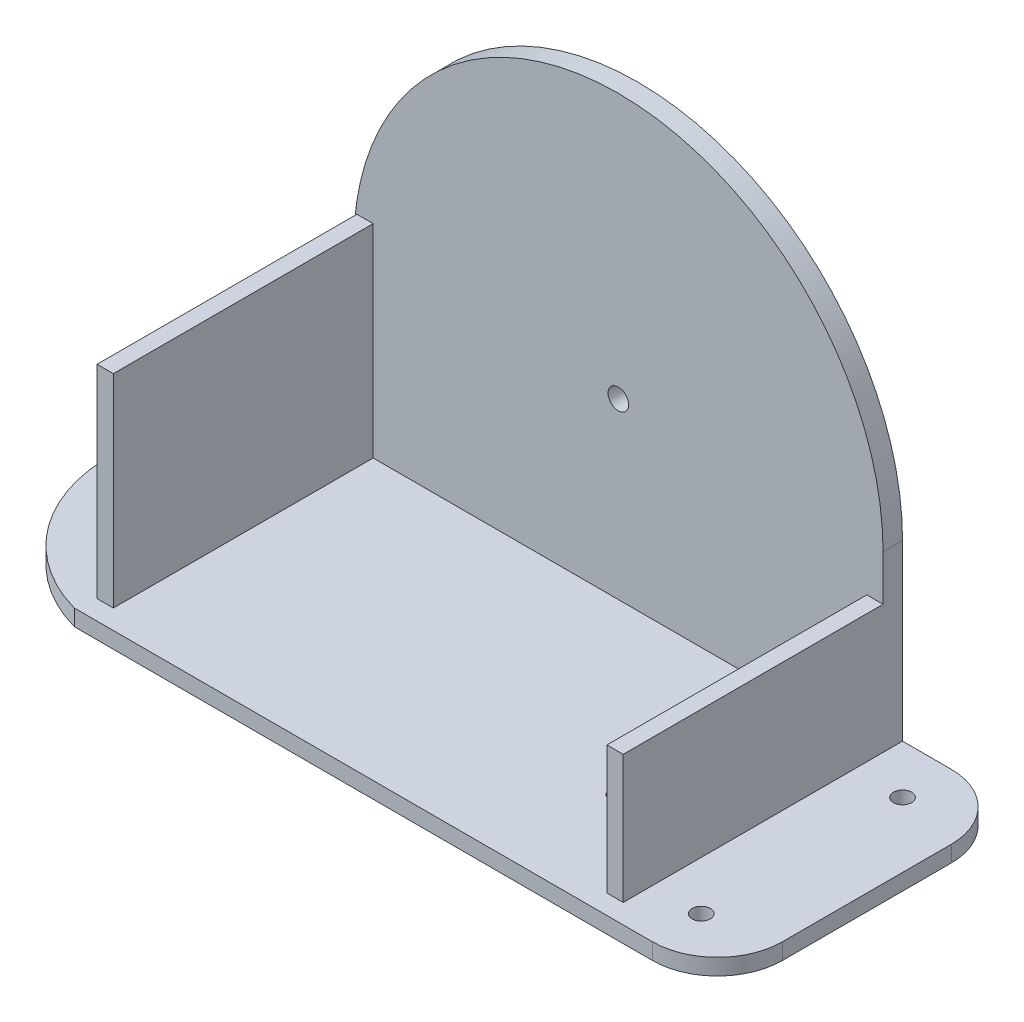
ISO-10303-21;
HEADER;
FILE_DESCRIPTION(('STEP AP214'),'2;1');
FILE_NAME('part.step','',(''),(''),'','','');
FILE_SCHEMA(('AUTOMOTIVE_DESIGN { 1 0 10303 214 1 1 1 1 }'));
ENDSEC;
DATA;
#1=APPLICATION_CONTEXT('core data for automotive mechanical design processes');
#2=APPLICATION_PROTOCOL_DEFINITION('international standard','automotive_design',2000,#1);
#3=PRODUCT_CONTEXT('',#1,'mechanical');
#4=PRODUCT('Part','Part','',(#3));
#5=PRODUCT_RELATED_PRODUCT_CATEGORY('part','',(#4));
#6=PRODUCT_DEFINITION_FORMATION('','',#4);
#7=PRODUCT_DEFINITION_CONTEXT('part definition',#1,'design');
#8=PRODUCT_DEFINITION('design','',#6,#7);
#9=PRODUCT_DEFINITION_SHAPE('','',#8);
#10=(LENGTH_UNIT() NAMED_UNIT(*) SI_UNIT(.MILLI.,.METRE.));
#11=(NAMED_UNIT(*) PLANE_ANGLE_UNIT() SI_UNIT($,.RADIAN.));
#12=(NAMED_UNIT(*) SI_UNIT($,.STERADIAN.) SOLID_ANGLE_UNIT());
#13=UNCERTAINTY_MEASURE_WITH_UNIT(LENGTH_MEASURE(1.E-05),#10,'distance_accuracy_value','');
#14=(GEOMETRIC_REPRESENTATION_CONTEXT(3) GLOBAL_UNCERTAINTY_ASSIGNED_CONTEXT((#13)) GLOBAL_UNIT_ASSIGNED_CONTEXT((#10,
#11,#12)) REPRESENTATION_CONTEXT('',''));
#15=CARTESIAN_POINT('',(0.,0.,0.));
#16=DIRECTION('',(0.,0.,1.));
#17=DIRECTION('',(1.,0.,0.));
#18=AXIS2_PLACEMENT_3D('',#15,#16,#17);
#19=CARTESIAN_POINT('',(51.5,-58.5,33.5));
#20=DIRECTION('',(0.,1.,0.));
#21=DIRECTION('',(0.,0.,1.));
#22=AXIS2_PLACEMENT_3D('',#19,#20,#21);
#23=CYLINDRICAL_SURFACE('',#22,2.);
#24=CARTESIAN_POINT('',(51.5,-53.5,33.5));
#25=DIRECTION('',(0.,1.,0.));
#26=DIRECTION('',(0.,0.,1.));
#27=AXIS2_PLACEMENT_3D('',#24,#25,#26);
#28=CIRCLE('',#27,2.);
#29=CARTESIAN_POINT('',(51.5,-53.5,35.5));
#30=VERTEX_POINT('',#29);
#31=EDGE_CURVE('E148',#30,#30,#28,.T.);
#32=ORIENTED_EDGE('',*,*,#31,.T.);
#33=EDGE_LOOP('',(#32));
#34=FACE_BOUND('',#33,.T.);
#35=CARTESIAN_POINT('',(51.5,-55.5,33.5));
#36=DIRECTION('',(0.,-1.,0.));
#37=DIRECTION('',(0.,0.,-1.));
#38=AXIS2_PLACEMENT_3D('',#35,#36,#37);
#39=CIRCLE('',#38,2.);
#40=CARTESIAN_POINT('',(51.5,-55.5,31.5));
#41=VERTEX_POINT('',#40);
#42=EDGE_CURVE('E51',#41,#41,#39,.F.);
#43=ORIENTED_EDGE('',*,*,#42,.F.);
#44=EDGE_LOOP('',(#43));
#45=FACE_BOUND('',#44,.T.);
#46=ADVANCED_FACE('F47',(#34,#45),#23,.F.);
#47=CARTESIAN_POINT('',(51.5,-58.5,58.5));
#48=DIRECTION('',(0.,1.,0.));
#49=DIRECTION('',(0.,0.,1.));
#50=AXIS2_PLACEMENT_3D('',#47,#48,#49);
#51=CYLINDRICAL_SURFACE('',#50,2.);
#52=CARTESIAN_POINT('',(51.5,-53.5,58.5));
#53=DIRECTION('',(0.,1.,0.));
#54=DIRECTION('',(0.,0.,1.));
#55=AXIS2_PLACEMENT_3D('',#52,#53,#54);
#56=CIRCLE('',#55,2.);
#57=CARTESIAN_POINT('',(51.5,-53.5,60.5));
#58=VERTEX_POINT('',#57);
#59=EDGE_CURVE('E171',#58,#58,#56,.T.);
#60=ORIENTED_EDGE('',*,*,#59,.T.);
#61=EDGE_LOOP('',(#60));
#62=FACE_BOUND('',#61,.T.);
#63=CARTESIAN_POINT('',(51.5,-55.5,58.5));
#64=DIRECTION('',(0.,-1.,0.));
#65=DIRECTION('',(0.,0.,-1.));
#66=AXIS2_PLACEMENT_3D('',#63,#64,#65);
#67=CIRCLE('',#66,2.);
#68=CARTESIAN_POINT('',(51.5,-55.5,56.5));
#69=VERTEX_POINT('',#68);
#70=EDGE_CURVE('E169',#69,#69,#67,.F.);
#71=ORIENTED_EDGE('',*,*,#70,.F.);
#72=EDGE_LOOP('',(#71));
#73=FACE_BOUND('',#72,.T.);
#74=ADVANCED_FACE('F218',(#62,#73),#51,.F.);
#75=CARTESIAN_POINT('',(-68.7714285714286,-58.5,46.));
#76=DIRECTION('',(0.,1.,0.));
#77=DIRECTION('',(0.,0.,1.));
#78=AXIS2_PLACEMENT_3D('',#75,#76,#77);
#79=CYLINDRICAL_SURFACE('',#78,47.7285714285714);
#80=CARTESIAN_POINT('',(-68.7714285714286,-53.5,46.));
#81=DIRECTION('',(0.,-1.,0.));
#82=DIRECTION('',(0.,0.,-1.));
#83=AXIS2_PLACEMENT_3D('',#80,#81,#82);
#84=CIRCLE('',#83,47.7285714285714);
#85=CARTESIAN_POINT('',(-81.5,-53.5,92.));
#86=VERTEX_POINT('',#85);
#87=CARTESIAN_POINT('',(-81.5,-53.5,0.));
#88=VERTEX_POINT('',#87);
#89=EDGE_CURVE('E144',#86,#88,#84,.T.);
#90=ORIENTED_EDGE('',*,*,#89,.T.);
#91=DIRECTION('',(0.,1.,0.));
#92=VECTOR('',#91,1.);
#93=CARTESIAN_POINT('',(-81.5,-58.5,0.));
#94=LINE('',#93,#92);
#95=CARTESIAN_POINT('',(-81.5,-58.5,0.));
#96=VERTEX_POINT('',#95);
#97=EDGE_CURVE('E12',#96,#88,#94,.T.);
#98=ORIENTED_EDGE('',*,*,#97,.F.);
#99=CARTESIAN_POINT('',(-68.7714285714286,-58.5,46.));
#100=DIRECTION('',(0.,-1.,0.));
#101=DIRECTION('',(0.,0.,-1.));
#102=AXIS2_PLACEMENT_3D('',#99,#100,#101);
#103=CIRCLE('',#102,47.7285714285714);
#104=CARTESIAN_POINT('',(-81.5,-58.5,92.));
#105=VERTEX_POINT('',#104);
#106=EDGE_CURVE('E164',#105,#96,#103,.T.);
#107=ORIENTED_EDGE('',*,*,#106,.F.);
#108=DIRECTION('',(0.,1.,0.));
#109=VECTOR('',#108,1.);
#110=CARTESIAN_POINT('',(-81.5,-58.5,92.));
#111=LINE('',#110,#109);
#112=EDGE_CURVE('E143',#105,#86,#111,.T.);
#113=ORIENTED_EDGE('',*,*,#112,.T.);
#114=EDGE_LOOP('',(#90,#98,#107,#113));
#115=FACE_BOUND('',#114,.T.);
#116=ADVANCED_FACE('F49',(#115),#79,.T.);
#117=CARTESIAN_POINT('',(0.,-58.5,0.));
#118=DIRECTION('',(0.,0.,1.));
#119=DIRECTION('',(1.,0.,0.));
#120=AXIS2_PLACEMENT_3D('',#117,#118,#119);
#121=PLANE('',#120);
#122=DIRECTION('',(1.,0.,0.));
#123=VECTOR('',#122,1.);
#124=CARTESIAN_POINT('',(0.,-53.5,0.));
#125=LINE('',#124,#123);
#126=CARTESIAN_POINT('',(96.4999999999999,-53.5,0.));
#127=VERTEX_POINT('',#126);
#128=EDGE_CURVE('E147',#88,#127,#125,.T.);
#129=ORIENTED_EDGE('',*,*,#128,.T.);
#130=DIRECTION('',(0.,1.,0.));
#131=VECTOR('',#130,1.);
#132=CARTESIAN_POINT('',(96.4999999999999,-58.5,0.));
#133=LINE('',#132,#131);
#134=CARTESIAN_POINT('',(96.4999999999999,-58.5,0.));
#135=VERTEX_POINT('',#134);
#136=EDGE_CURVE('E57',#135,#127,#133,.T.);
#137=ORIENTED_EDGE('',*,*,#136,.F.);
#138=DIRECTION('',(1.,0.,0.));
#139=VECTOR('',#138,1.);
#140=CARTESIAN_POINT('',(0.,-58.5,0.));
#141=LINE('',#140,#139);
#142=EDGE_CURVE('E103',#96,#135,#141,.T.);
#143=ORIENTED_EDGE('',*,*,#142,.F.);
#144=ORIENTED_EDGE('',*,*,#97,.T.);
#145=EDGE_LOOP('',(#129,#137,#143,#144));
#146=FACE_BOUND('',#145,.T.);
#147=ADVANCED_FACE('F193',(#146),#121,.F.);
#148=CARTESIAN_POINT('',(96.5,-58.5,20.));
#149=DIRECTION('',(0.,1.,0.));
#150=DIRECTION('',(0.,0.,1.));
#151=AXIS2_PLACEMENT_3D('',#148,#149,#150);
#152=CYLINDRICAL_SURFACE('',#151,20.);
#153=CARTESIAN_POINT('',(96.5,-53.5,20.));
#154=DIRECTION('',(0.,-1.,0.));
#155=DIRECTION('',(0.,0.,-1.));
#156=AXIS2_PLACEMENT_3D('',#153,#154,#155);
#157=CIRCLE('',#156,20.);
#158=CARTESIAN_POINT('',(116.5,-53.5,20.0000000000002));
#159=VERTEX_POINT('',#158);
#160=EDGE_CURVE('E150',#127,#159,#157,.T.);
#161=ORIENTED_EDGE('',*,*,#160,.T.);
#162=DIRECTION('',(0.,1.,0.));
#163=VECTOR('',#162,1.);
#164=CARTESIAN_POINT('',(116.5,-58.5,20.0000000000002));
#165=LINE('',#164,#163);
#166=CARTESIAN_POINT('',(116.5,-58.5,20.0000000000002));
#167=VERTEX_POINT('',#166);
#168=EDGE_CURVE('E126',#167,#159,#165,.T.);
#169=ORIENTED_EDGE('',*,*,#168,.F.);
#170=CARTESIAN_POINT('',(96.5,-58.5,20.));
#171=DIRECTION('',(0.,-1.,0.));
#172=DIRECTION('',(0.,0.,-1.));
#173=AXIS2_PLACEMENT_3D('',#170,#171,#172);
#174=CIRCLE('',#173,20.);
#175=EDGE_CURVE('E117',#135,#167,#174,.T.);
#176=ORIENTED_EDGE('',*,*,#175,.F.);
#177=ORIENTED_EDGE('',*,*,#136,.T.);
#178=EDGE_LOOP('',(#161,#169,#176,#177));
#179=FACE_BOUND('',#178,.T.);
#180=ADVANCED_FACE('F196',(#179),#152,.T.);
#181=CARTESIAN_POINT('',(116.5,-58.5,0.));
#182=DIRECTION('',(-1.,0.,0.));
#183=DIRECTION('',(0.,0.,1.));
#184=AXIS2_PLACEMENT_3D('',#181,#182,#183);
#185=PLANE('',#184);
#186=DIRECTION('',(0.,0.,1.));
#187=VECTOR('',#186,1.);
#188=CARTESIAN_POINT('',(116.5,-53.5,0.));
#189=LINE('',#188,#187);
#190=CARTESIAN_POINT('',(116.5,-53.5,71.9999999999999));
#191=VERTEX_POINT('',#190);
#192=EDGE_CURVE('E125',#159,#191,#189,.T.);
#193=ORIENTED_EDGE('',*,*,#192,.T.);
#194=DIRECTION('',(0.,1.,0.));
#195=VECTOR('',#194,1.);
#196=CARTESIAN_POINT('',(116.5,-58.5,71.9999999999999));
#197=LINE('',#196,#195);
#198=CARTESIAN_POINT('',(116.5,-58.5,71.9999999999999));
#199=VERTEX_POINT('',#198);
#200=EDGE_CURVE('E122',#199,#191,#197,.T.);
#201=ORIENTED_EDGE('',*,*,#200,.F.);
#202=DIRECTION('',(0.,0.,1.));
#203=VECTOR('',#202,1.);
#204=CARTESIAN_POINT('',(116.5,-58.5,0.));
#205=LINE('',#204,#203);
#206=EDGE_CURVE('E110',#167,#199,#205,.T.);
#207=ORIENTED_EDGE('',*,*,#206,.F.);
#208=ORIENTED_EDGE('',*,*,#168,.T.);
#209=EDGE_LOOP('',(#193,#201,#207,#208));
#210=FACE_BOUND('',#209,.T.);
#211=ADVANCED_FACE('F123',(#210),#185,.F.);
#212=CARTESIAN_POINT('',(96.5,-58.5,72.));
#213=DIRECTION('',(0.,1.,0.));
#214=DIRECTION('',(0.,0.,1.));
#215=AXIS2_PLACEMENT_3D('',#212,#213,#214);
#216=CYLINDRICAL_SURFACE('',#215,20.);
#217=CARTESIAN_POINT('',(96.5,-53.5,72.));
#218=DIRECTION('',(0.,-1.,0.));
#219=DIRECTION('',(0.,0.,-1.));
#220=AXIS2_PLACEMENT_3D('',#217,#218,#219);
#221=CIRCLE('',#220,20.);
#222=CARTESIAN_POINT('',(96.4999999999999,-53.5,92.));
#223=VERTEX_POINT('',#222);
#224=EDGE_CURVE('E89',#191,#223,#221,.T.);
#225=ORIENTED_EDGE('',*,*,#224,.T.);
#226=DIRECTION('',(0.,1.,0.));
#227=VECTOR('',#226,1.);
#228=CARTESIAN_POINT('',(96.4999999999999,-58.5,92.));
#229=LINE('',#228,#227);
#230=CARTESIAN_POINT('',(96.4999999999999,-58.5,92.));
#231=VERTEX_POINT('',#230);
#232=EDGE_CURVE('E127',#231,#223,#229,.T.);
#233=ORIENTED_EDGE('',*,*,#232,.F.);
#234=CARTESIAN_POINT('',(96.5,-58.5,72.));
#235=DIRECTION('',(0.,-1.,0.));
#236=DIRECTION('',(0.,0.,-1.));
#237=AXIS2_PLACEMENT_3D('',#234,#235,#236);
#238=CIRCLE('',#237,20.);
#239=EDGE_CURVE('E115',#199,#231,#238,.T.);
#240=ORIENTED_EDGE('',*,*,#239,.F.);
#241=ORIENTED_EDGE('',*,*,#200,.T.);
#242=EDGE_LOOP('',(#225,#233,#240,#241));
#243=FACE_BOUND('',#242,.T.);
#244=ADVANCED_FACE('F129',(#243),#216,.T.);
#245=CARTESIAN_POINT('',(96.5,-58.5,15.));
#246=DIRECTION('',(0.,1.,0.));
#247=DIRECTION('',(0.,0.,1.));
#248=AXIS2_PLACEMENT_3D('',#245,#246,#247);
#249=CYLINDRICAL_SURFACE('',#248,2.79999999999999);
#250=CARTESIAN_POINT('',(96.5,-58.5,15.));
#251=DIRECTION('',(0.,-1.,0.));
#252=DIRECTION('',(0.,0.,-1.));
#253=AXIS2_PLACEMENT_3D('',#250,#251,#252);
#254=CIRCLE('',#253,2.79999999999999);
#255=CARTESIAN_POINT('',(96.5,-58.5,12.2));
#256=VERTEX_POINT('',#255);
#257=EDGE_CURVE('E137',#256,#256,#254,.T.);
#258=ORIENTED_EDGE('',*,*,#257,.T.);
#259=EDGE_LOOP('',(#258));
#260=FACE_BOUND('',#259,.T.);
#261=CARTESIAN_POINT('',(96.5,-53.5,15.));
#262=DIRECTION('',(0.,-1.,0.));
#263=DIRECTION('',(0.,0.,-1.));
#264=AXIS2_PLACEMENT_3D('',#261,#262,#263);
#265=CIRCLE('',#264,2.79999999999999);
#266=CARTESIAN_POINT('',(96.5,-53.5,12.2));
#267=VERTEX_POINT('',#266);
#268=EDGE_CURVE('E158',#267,#267,#265,.T.);
#269=ORIENTED_EDGE('',*,*,#268,.F.);
#270=EDGE_LOOP('',(#269));
#271=FACE_BOUND('',#270,.T.);
#272=ADVANCED_FACE('F213',(#260,#271),#249,.F.);
#273=CARTESIAN_POINT('',(-95.5,-58.5,46.));
#274=DIRECTION('',(0.,1.,0.));
#275=DIRECTION('',(0.,0.,1.));
#276=AXIS2_PLACEMENT_3D('',#273,#274,#275);
#277=CYLINDRICAL_SURFACE('',#276,2.79999999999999);
#278=CARTESIAN_POINT('',(-95.5,-58.5,46.));
#279=DIRECTION('',(0.,-1.,0.));
#280=DIRECTION('',(0.,0.,-1.));
#281=AXIS2_PLACEMENT_3D('',#278,#279,#280);
#282=CIRCLE('',#281,2.79999999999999);
#283=CARTESIAN_POINT('',(-95.5,-58.5,43.2));
#284=VERTEX_POINT('',#283);
#285=EDGE_CURVE('E131',#284,#284,#282,.T.);
#286=ORIENTED_EDGE('',*,*,#285,.T.);
#287=EDGE_LOOP('',(#286));
#288=FACE_BOUND('',#287,.T.);
#289=CARTESIAN_POINT('',(-95.5,-53.5,46.));
#290=DIRECTION('',(0.,-1.,0.));
#291=DIRECTION('',(0.,0.,-1.));
#292=AXIS2_PLACEMENT_3D('',#289,#290,#291);
#293=CIRCLE('',#292,2.79999999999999);
#294=CARTESIAN_POINT('',(-95.5,-53.5,43.2));
#295=VERTEX_POINT('',#294);
#296=EDGE_CURVE('E155',#295,#295,#293,.T.);
#297=ORIENTED_EDGE('',*,*,#296,.F.);
#298=EDGE_LOOP('',(#297));
#299=FACE_BOUND('',#298,.T.);
#300=ADVANCED_FACE('F205',(#288,#299),#277,.F.);
#301=CARTESIAN_POINT('',(0.,-58.5,92.));
#302=DIRECTION('',(0.,0.,-1.));
#303=DIRECTION('',(-1.,0.,0.));
#304=AXIS2_PLACEMENT_3D('',#301,#302,#303);
#305=PLANE('',#304);
#306=DIRECTION('',(-1.,0.,0.));
#307=VECTOR('',#306,1.);
#308=CARTESIAN_POINT('',(0.,-53.5,92.));
#309=LINE('',#308,#307);
#310=EDGE_CURVE('E95',#223,#86,#309,.T.);
#311=ORIENTED_EDGE('',*,*,#310,.T.);
#312=ORIENTED_EDGE('',*,*,#112,.F.);
#313=DIRECTION('',(-1.,0.,0.));
#314=VECTOR('',#313,1.);
#315=CARTESIAN_POINT('',(0.,-58.5,92.));
#316=LINE('',#315,#314);
#317=EDGE_CURVE('E66',#231,#105,#316,.T.);
#318=ORIENTED_EDGE('',*,*,#317,.F.);
#319=ORIENTED_EDGE('',*,*,#232,.T.);
#320=EDGE_LOOP('',(#311,#312,#318,#319));
#321=FACE_BOUND('',#320,.T.);
#322=ADVANCED_FACE('F202',(#321),#305,.F.);
#323=CARTESIAN_POINT('',(96.5,-58.5,77.));
#324=DIRECTION('',(0.,1.,0.));
#325=DIRECTION('',(0.,0.,1.));
#326=AXIS2_PLACEMENT_3D('',#323,#324,#325);
#327=CYLINDRICAL_SURFACE('',#326,2.79999999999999);
#328=CARTESIAN_POINT('',(96.5,-58.5,77.));
#329=DIRECTION('',(0.,-1.,0.));
#330=DIRECTION('',(0.,0.,-1.));
#331=AXIS2_PLACEMENT_3D('',#328,#329,#330);
#332=CIRCLE('',#331,2.79999999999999);
#333=CARTESIAN_POINT('',(96.5,-58.5,74.2));
#334=VERTEX_POINT('',#333);
#335=EDGE_CURVE('E140',#334,#334,#332,.T.);
#336=ORIENTED_EDGE('',*,*,#335,.T.);
#337=EDGE_LOOP('',(#336));
#338=FACE_BOUND('',#337,.T.);
#339=CARTESIAN_POINT('',(96.5,-53.5,77.));
#340=DIRECTION('',(0.,-1.,0.));
#341=DIRECTION('',(0.,0.,-1.));
#342=AXIS2_PLACEMENT_3D('',#339,#340,#341);
#343=CIRCLE('',#342,2.79999999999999);
#344=CARTESIAN_POINT('',(96.5,-53.5,74.2));
#345=VERTEX_POINT('',#344);
#346=EDGE_CURVE('E161',#345,#345,#343,.T.);
#347=ORIENTED_EDGE('',*,*,#346,.F.);
#348=EDGE_LOOP('',(#347));
#349=FACE_BOUND('',#348,.T.);
#350=ADVANCED_FACE('F204',(#338,#349),#327,.F.);
#351=CARTESIAN_POINT('',(0.,-58.5,0.));
#352=DIRECTION('',(0.,-1.,0.));
#353=DIRECTION('',(0.,0.,-1.));
#354=AXIS2_PLACEMENT_3D('',#351,#352,#353);
#355=PLANE('',#354);
#356=CARTESIAN_POINT('',(51.5,-58.5,33.5));
#357=DIRECTION('',(0.,-1.,0.));
#358=DIRECTION('',(0.,0.,-1.));
#359=AXIS2_PLACEMENT_3D('',#356,#357,#358);
#360=CIRCLE('',#359,3.);
#361=CARTESIAN_POINT('',(51.5,-58.5,30.5));
#362=VERTEX_POINT('',#361);
#363=EDGE_CURVE('E185',#362,#362,#360,.T.);
#364=ORIENTED_EDGE('',*,*,#363,.F.);
#365=EDGE_LOOP('',(#364));
#366=FACE_BOUND('',#365,.T.);
#367=CARTESIAN_POINT('',(51.5,-58.5,58.5));
#368=DIRECTION('',(0.,-1.,0.));
#369=DIRECTION('',(0.,0.,-1.));
#370=AXIS2_PLACEMENT_3D('',#367,#368,#369);
#371=CIRCLE('',#370,3.);
#372=CARTESIAN_POINT('',(51.5,-58.5,55.5));
#373=VERTEX_POINT('',#372);
#374=EDGE_CURVE('E178',#373,#373,#371,.T.);
#375=ORIENTED_EDGE('',*,*,#374,.F.);
#376=EDGE_LOOP('',(#375));
#377=FACE_BOUND('',#376,.T.);
#378=ORIENTED_EDGE('',*,*,#106,.T.);
#379=ORIENTED_EDGE('',*,*,#142,.T.);
#380=ORIENTED_EDGE('',*,*,#175,.T.);
#381=ORIENTED_EDGE('',*,*,#206,.T.);
#382=ORIENTED_EDGE('',*,*,#239,.T.);
#383=ORIENTED_EDGE('',*,*,#317,.T.);
#384=EDGE_LOOP('',(#378,#379,#380,#381,#382,#383));
#385=FACE_BOUND('',#384,.T.);
#386=ORIENTED_EDGE('',*,*,#285,.F.);
#387=EDGE_LOOP('',(#386));
#388=FACE_BOUND('',#387,.T.);
#389=ORIENTED_EDGE('',*,*,#257,.F.);
#390=EDGE_LOOP('',(#389));
#391=FACE_BOUND('',#390,.T.);
#392=ORIENTED_EDGE('',*,*,#335,.F.);
#393=EDGE_LOOP('',(#392));
#394=FACE_BOUND('',#393,.T.);
#395=ADVANCED_FACE('F112',(#366,#377,#385,#388,#391,#394),#355,.T.);
#396=CARTESIAN_POINT('',(0.,-53.5,0.));
#397=DIRECTION('',(0.,-1.,0.));
#398=DIRECTION('',(0.,0.,-1.));
#399=AXIS2_PLACEMENT_3D('',#396,#397,#398);
#400=PLANE('',#399);
#401=ORIENTED_EDGE('',*,*,#59,.F.);
#402=EDGE_LOOP('',(#401));
#403=FACE_BOUND('',#402,.T.);
#404=ORIENTED_EDGE('',*,*,#31,.F.);
#405=EDGE_LOOP('',(#404));
#406=FACE_BOUND('',#405,.T.);
#407=ORIENTED_EDGE('',*,*,#89,.F.);
#408=ORIENTED_EDGE('',*,*,#310,.F.);
#409=ORIENTED_EDGE('',*,*,#224,.F.);
#410=ORIENTED_EDGE('',*,*,#192,.F.);
#411=ORIENTED_EDGE('',*,*,#160,.F.);
#412=ORIENTED_EDGE('',*,*,#128,.F.);
#413=EDGE_LOOP('',(#407,#408,#409,#410,#411,#412));
#414=FACE_BOUND('',#413,.T.);
#415=ORIENTED_EDGE('',*,*,#296,.T.);
#416=EDGE_LOOP('',(#415));
#417=FACE_BOUND('',#416,.T.);
#418=ORIENTED_EDGE('',*,*,#268,.T.);
#419=EDGE_LOOP('',(#418));
#420=FACE_BOUND('',#419,.T.);
#421=ORIENTED_EDGE('',*,*,#346,.T.);
#422=EDGE_LOOP('',(#421));
#423=FACE_BOUND('',#422,.T.);
#424=ADVANCED_FACE('F199',(#403,#406,#414,#417,#420,#423),#400,.F.);
#425=CARTESIAN_POINT('',(51.5,-55.5,58.5));
#426=DIRECTION('',(0.,-1.,0.));
#427=DIRECTION('',(0.,0.,-1.));
#428=AXIS2_PLACEMENT_3D('',#425,#426,#427);
#429=PLANE('',#428);
#430=CARTESIAN_POINT('',(51.5,-55.5,58.5));
#431=DIRECTION('',(0.,-1.,0.));
#432=DIRECTION('',(0.,0.,-1.));
#433=AXIS2_PLACEMENT_3D('',#430,#431,#432);
#434=CIRCLE('',#433,3.);
#435=CARTESIAN_POINT('',(51.5,-55.5,55.5));
#436=VERTEX_POINT('',#435);
#437=EDGE_CURVE('E172',#436,#436,#434,.T.);
#438=ORIENTED_EDGE('',*,*,#437,.T.);
#439=EDGE_LOOP('',(#438));
#440=FACE_BOUND('',#439,.T.);
#441=ORIENTED_EDGE('',*,*,#70,.T.);
#442=EDGE_LOOP('',(#441));
#443=FACE_BOUND('',#442,.T.);
#444=ADVANCED_FACE('F233',(#440,#443),#429,.T.);
#445=CARTESIAN_POINT('',(51.5,-55.5,58.5));
#446=DIRECTION('',(0.,-1.,0.));
#447=DIRECTION('',(0.,0.,-1.));
#448=AXIS2_PLACEMENT_3D('',#445,#446,#447);
#449=CYLINDRICAL_SURFACE('',#448,3.);
#450=ORIENTED_EDGE('',*,*,#437,.F.);
#451=EDGE_LOOP('',(#450));
#452=FACE_BOUND('',#451,.T.);
#453=ORIENTED_EDGE('',*,*,#374,.T.);
#454=EDGE_LOOP('',(#453));
#455=FACE_BOUND('',#454,.T.);
#456=ADVANCED_FACE('F288',(#452,#455),#449,.F.);
#457=CARTESIAN_POINT('',(51.5,-55.5,33.5));
#458=DIRECTION('',(0.,-1.,0.));
#459=DIRECTION('',(0.,0.,-1.));
#460=AXIS2_PLACEMENT_3D('',#457,#458,#459);
#461=PLANE('',#460);
#462=CARTESIAN_POINT('',(51.5,-55.5,33.5));
#463=DIRECTION('',(0.,-1.,0.));
#464=DIRECTION('',(0.,0.,-1.));
#465=AXIS2_PLACEMENT_3D('',#462,#463,#464);
#466=CIRCLE('',#465,3.);
#467=CARTESIAN_POINT('',(51.5,-55.5,30.5));
#468=VERTEX_POINT('',#467);
#469=EDGE_CURVE('E323',#468,#468,#466,.T.);
#470=ORIENTED_EDGE('',*,*,#469,.T.);
#471=EDGE_LOOP('',(#470));
#472=FACE_BOUND('',#471,.T.);
#473=ORIENTED_EDGE('',*,*,#42,.T.);
#474=EDGE_LOOP('',(#473));
#475=FACE_BOUND('',#474,.T.);
#476=ADVANCED_FACE('F297',(#472,#475),#461,.T.);
#477=CARTESIAN_POINT('',(51.5,-55.5,33.5));
#478=DIRECTION('',(0.,-1.,0.));
#479=DIRECTION('',(0.,0.,-1.));
#480=AXIS2_PLACEMENT_3D('',#477,#478,#479);
#481=CYLINDRICAL_SURFACE('',#480,3.);
#482=ORIENTED_EDGE('',*,*,#469,.F.);
#483=EDGE_LOOP('',(#482));
#484=FACE_BOUND('',#483,.T.);
#485=ORIENTED_EDGE('',*,*,#363,.T.);
#486=EDGE_LOOP('',(#485));
#487=FACE_BOUND('',#486,.T.);
#488=ADVANCED_FACE('F306',(#484,#487),#481,.F.);
#489=CLOSED_SHELL('',(#46,#74,#116,#147,#180,#211,#244,#272,#300,#322,#350,#395,#424,#444,#456,
#476,#488));
#490=MANIFOLD_SOLID_BREP('B2',#489);
#491=CARTESIAN_POINT('',(0.,0.,6.));
#492=DIRECTION('',(0.,0.,1.));
#493=DIRECTION('',(1.,0.,0.));
#494=AXIS2_PLACEMENT_3D('',#491,#492,#493);
#495=PLANE('',#494);
#496=CARTESIAN_POINT('',(0.,0.,6.));
#497=DIRECTION('',(0.,0.,1.));
#498=DIRECTION('',(1.,0.,0.));
#499=AXIS2_PLACEMENT_3D('',#496,#497,#498);
#500=CIRCLE('',#499,3.175);
#501=CARTESIAN_POINT('',(3.175,0.,6.));
#502=VERTEX_POINT('',#501);
#503=EDGE_CURVE('E516',#502,#502,#500,.T.);
#504=ORIENTED_EDGE('',*,*,#503,.F.);
#505=EDGE_LOOP('',(#504));
#506=FACE_BOUND('',#505,.T.);
#507=DIRECTION('',(0.,-1.,0.));
#508=VECTOR('',#507,1.);
#509=CARTESIAN_POINT('',(-75.5,9.,6.));
#510=LINE('',#509,#508);
#511=CARTESIAN_POINT('',(-75.5,9.,6.));
#512=VERTEX_POINT('',#511);
#513=CARTESIAN_POINT('',(-75.5,-53.5,6.));
#514=VERTEX_POINT('',#513);
#515=EDGE_CURVE('E499',#512,#514,#510,.T.);
#516=ORIENTED_EDGE('',*,*,#515,.T.);
#517=DIRECTION('',(1.,0.,0.));
#518=VECTOR('',#517,1.);
#519=CARTESIAN_POINT('',(0.,-53.5,6.));
#520=LINE('',#519,#518);
#521=CARTESIAN_POINT('',(76.5,-53.5,6.));
#522=VERTEX_POINT('',#521);
#523=EDGE_CURVE('E486',#514,#522,#520,.T.);
#524=ORIENTED_EDGE('',*,*,#523,.T.);
#525=DIRECTION('',(0.,1.,0.));
#526=VECTOR('',#525,1.);
#527=CARTESIAN_POINT('',(76.5,-53.5,6.));
#528=LINE('',#527,#526);
#529=CARTESIAN_POINT('',(76.5,-14.,6.));
#530=VERTEX_POINT('',#529);
#531=EDGE_CURVE('E501',#522,#530,#528,.T.);
#532=ORIENTED_EDGE('',*,*,#531,.T.);
#533=DIRECTION('',(-1.,0.,0.));
#534=VECTOR('',#533,1.);
#535=CARTESIAN_POINT('',(81.5,-14.,6.));
#536=LINE('',#535,#534);
#537=CARTESIAN_POINT('',(81.5,-14.,6.));
#538=VERTEX_POINT('',#537);
#539=EDGE_CURVE('E532',#538,#530,#536,.T.);
#540=ORIENTED_EDGE('',*,*,#539,.F.);
#541=DIRECTION('',(0.,1.,0.));
#542=VECTOR('',#541,1.);
#543=CARTESIAN_POINT('',(81.5,0.,6.));
#544=LINE('',#543,#542);
#545=CARTESIAN_POINT('',(81.5,0.,6.));
#546=VERTEX_POINT('',#545);
#547=EDGE_CURVE('E550',#538,#546,#544,.T.);
#548=ORIENTED_EDGE('',*,*,#547,.T.);
#549=CARTESIAN_POINT('',(0.,0.,6.));
#550=DIRECTION('',(0.,0.,1.));
#551=DIRECTION('',(1.,0.,0.));
#552=AXIS2_PLACEMENT_3D('',#549,#550,#551);
#553=CIRCLE('',#552,81.5);
#554=CARTESIAN_POINT('',(-81.5,0.,6.));
#555=VERTEX_POINT('',#554);
#556=EDGE_CURVE('E552',#546,#555,#553,.T.);
#557=ORIENTED_EDGE('',*,*,#556,.T.);
#558=DIRECTION('',(0.,1.,0.));
#559=VECTOR('',#558,1.);
#560=CARTESIAN_POINT('',(-81.5,1.67561437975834E-13,6.));
#561=LINE('',#560,#559);
#562=CARTESIAN_POINT('',(-81.5,-53.5,6.));
#563=VERTEX_POINT('',#562);
#564=EDGE_CURVE('E496',#563,#555,#561,.T.);
#565=ORIENTED_EDGE('',*,*,#564,.F.);
#566=CARTESIAN_POINT('',(-80.5,-53.5,6.));
#567=VERTEX_POINT('',#566);
#568=EDGE_CURVE('E495',#563,#567,#520,.T.);
#569=ORIENTED_EDGE('',*,*,#568,.T.);
#570=DIRECTION('',(0.,-1.,0.));
#571=VECTOR('',#570,1.);
#572=CARTESIAN_POINT('',(-80.5,9.,6.));
#573=LINE('',#572,#571);
#574=CARTESIAN_POINT('',(-80.5,9.,6.));
#575=VERTEX_POINT('',#574);
#576=EDGE_CURVE('E423',#575,#567,#573,.T.);
#577=ORIENTED_EDGE('',*,*,#576,.F.);
#578=DIRECTION('',(1.,0.,0.));
#579=VECTOR('',#578,1.);
#580=CARTESIAN_POINT('',(-80.5,9.,6.));
#581=LINE('',#580,#579);
#582=EDGE_CURVE('E418',#575,#512,#581,.T.);
#583=ORIENTED_EDGE('',*,*,#582,.T.);
#584=EDGE_LOOP('',(#516,#524,#532,#540,#548,#557,#565,#569,#577,#583));
#585=FACE_BOUND('',#584,.T.);
#586=ADVANCED_FACE('F403',(#506,#585),#495,.T.);
#587=CARTESIAN_POINT('',(81.5,0.,6.));
#588=DIRECTION('',(-1.,0.,0.));
#589=DIRECTION('',(0.,0.,1.));
#590=AXIS2_PLACEMENT_3D('',#587,#588,#589);
#591=PLANE('',#590);
#592=DIRECTION('',(0.,1.,0.));
#593=VECTOR('',#592,1.);
#594=CARTESIAN_POINT('',(81.5,0.,0.));
#595=LINE('',#594,#593);
#596=CARTESIAN_POINT('',(81.5,-53.5,0.));
#597=VERTEX_POINT('',#596);
#598=CARTESIAN_POINT('',(81.5,0.,0.));
#599=VERTEX_POINT('',#598);
#600=EDGE_CURVE('E545',#597,#599,#595,.T.);
#601=ORIENTED_EDGE('',*,*,#600,.T.);
#602=DIRECTION('',(0.,0.,-1.));
#603=VECTOR('',#602,1.);
#604=CARTESIAN_POINT('',(81.5,0.,6.));
#605=LINE('',#604,#603);
#606=EDGE_CURVE('E45',#546,#599,#605,.T.);
#607=ORIENTED_EDGE('',*,*,#606,.F.);
#608=ORIENTED_EDGE('',*,*,#547,.F.);
#609=DIRECTION('',(0.,0.,-1.));
#610=VECTOR('',#609,1.);
#611=CARTESIAN_POINT('',(81.5,-14.,86.));
#612=LINE('',#611,#610);
#613=CARTESIAN_POINT('',(81.5,-14.,86.));
#614=VERTEX_POINT('',#613);
#615=EDGE_CURVE('E542',#614,#538,#612,.T.);
#616=ORIENTED_EDGE('',*,*,#615,.F.);
#617=DIRECTION('',(0.,1.,0.));
#618=VECTOR('',#617,1.);
#619=CARTESIAN_POINT('',(81.5,-53.5,86.));
#620=LINE('',#619,#618);
#621=CARTESIAN_POINT('',(81.5,-53.5,86.));
#622=VERTEX_POINT('',#621);
#623=EDGE_CURVE('E537',#622,#614,#620,.T.);
#624=ORIENTED_EDGE('',*,*,#623,.F.);
#625=DIRECTION('',(0.,0.,-1.));
#626=VECTOR('',#625,1.);
#627=CARTESIAN_POINT('',(81.5,-53.5,6.));
#628=LINE('',#627,#626);
#629=EDGE_CURVE('E557',#622,#597,#628,.T.);
#630=ORIENTED_EDGE('',*,*,#629,.T.);
#631=EDGE_LOOP('',(#601,#607,#608,#616,#624,#630));
#632=FACE_BOUND('',#631,.T.);
#633=ADVANCED_FACE('F405',(#632),#591,.F.);
#634=CARTESIAN_POINT('',(0.,0.,6.));
#635=DIRECTION('',(0.,0.,-1.));
#636=DIRECTION('',(-1.,0.,0.));
#637=AXIS2_PLACEMENT_3D('',#634,#635,#636);
#638=CYLINDRICAL_SURFACE('',#637,81.5);
#639=CARTESIAN_POINT('',(0.,0.,0.));
#640=DIRECTION('',(0.,0.,1.));
#641=DIRECTION('',(1.,0.,0.));
#642=AXIS2_PLACEMENT_3D('',#639,#640,#641);
#643=CIRCLE('',#642,81.5);
#644=CARTESIAN_POINT('',(-81.5,0.,0.));
#645=VERTEX_POINT('',#644);
#646=EDGE_CURVE('E560',#599,#645,#643,.T.);
#647=ORIENTED_EDGE('',*,*,#646,.T.);
#648=DIRECTION('',(0.,0.,-1.));
#649=VECTOR('',#648,1.);
#650=CARTESIAN_POINT('',(-81.5,0.,6.));
#651=LINE('',#650,#649);
#652=EDGE_CURVE('E411',#555,#645,#651,.T.);
#653=ORIENTED_EDGE('',*,*,#652,.F.);
#654=ORIENTED_EDGE('',*,*,#556,.F.);
#655=ORIENTED_EDGE('',*,*,#606,.T.);
#656=EDGE_LOOP('',(#647,#653,#654,#655));
#657=FACE_BOUND('',#656,.T.);
#658=ADVANCED_FACE('F577',(#657),#638,.T.);
#659=CARTESIAN_POINT('',(-81.5,1.67561437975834E-13,6.));
#660=DIRECTION('',(-1.,0.,0.));
#661=DIRECTION('',(0.,-1.,0.));
#662=AXIS2_PLACEMENT_3D('',#659,#660,#661);
#663=PLANE('',#662);
#664=DIRECTION('',(0.,1.,0.));
#665=VECTOR('',#664,1.);
#666=CARTESIAN_POINT('',(-81.5,1.67561437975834E-13,0.));
#667=LINE('',#666,#665);
#668=CARTESIAN_POINT('',(-81.5,-53.5,0.));
#669=VERTEX_POINT('',#668);
#670=EDGE_CURVE('E563',#669,#645,#667,.T.);
#671=ORIENTED_EDGE('',*,*,#670,.F.);
#672=DIRECTION('',(0.,0.,-1.));
#673=VECTOR('',#672,1.);
#674=CARTESIAN_POINT('',(-81.5,-53.5,6.));
#675=LINE('',#674,#673);
#676=EDGE_CURVE('E569',#563,#669,#675,.T.);
#677=ORIENTED_EDGE('',*,*,#676,.F.);
#678=ORIENTED_EDGE('',*,*,#564,.T.);
#679=ORIENTED_EDGE('',*,*,#652,.T.);
#680=EDGE_LOOP('',(#671,#677,#678,#679));
#681=FACE_BOUND('',#680,.T.);
#682=ADVANCED_FACE('F573',(#681),#663,.T.);
#683=CARTESIAN_POINT('',(0.,-53.5,6.));
#684=DIRECTION('',(0.,1.,0.));
#685=DIRECTION('',(0.,0.,1.));
#686=AXIS2_PLACEMENT_3D('',#683,#684,#685);
#687=PLANE('',#686);
#688=DIRECTION('',(1.,0.,0.));
#689=VECTOR('',#688,1.);
#690=CARTESIAN_POINT('',(0.,-53.5,0.));
#691=LINE('',#690,#689);
#692=EDGE_CURVE('E553',#669,#597,#691,.T.);
#693=ORIENTED_EDGE('',*,*,#692,.T.);
#694=ORIENTED_EDGE('',*,*,#629,.F.);
#695=DIRECTION('',(-1.,0.,0.));
#696=VECTOR('',#695,1.);
#697=CARTESIAN_POINT('',(81.5,-53.5,86.));
#698=LINE('',#697,#696);
#699=CARTESIAN_POINT('',(76.5,-53.5,86.));
#700=VERTEX_POINT('',#699);
#701=EDGE_CURVE('E529',#622,#700,#698,.T.);
#702=ORIENTED_EDGE('',*,*,#701,.T.);
#703=DIRECTION('',(0.,0.,-1.));
#704=VECTOR('',#703,1.);
#705=CARTESIAN_POINT('',(76.5,-53.5,86.));
#706=LINE('',#705,#704);
#707=EDGE_CURVE('E493',#700,#522,#706,.T.);
#708=ORIENTED_EDGE('',*,*,#707,.T.);
#709=ORIENTED_EDGE('',*,*,#523,.F.);
#710=DIRECTION('',(0.,0.,-1.));
#711=VECTOR('',#710,1.);
#712=CARTESIAN_POINT('',(-75.5,-53.5,86.));
#713=LINE('',#712,#711);
#714=CARTESIAN_POINT('',(-75.5,-53.5,86.));
#715=VERTEX_POINT('',#714);
#716=EDGE_CURVE('E490',#715,#514,#713,.T.);
#717=ORIENTED_EDGE('',*,*,#716,.F.);
#718=DIRECTION('',(1.,0.,0.));
#719=VECTOR('',#718,1.);
#720=CARTESIAN_POINT('',(-80.5,-53.5,86.));
#721=LINE('',#720,#719);
#722=CARTESIAN_POINT('',(-80.5,-53.5,86.));
#723=VERTEX_POINT('',#722);
#724=EDGE_CURVE('E526',#723,#715,#721,.T.);
#725=ORIENTED_EDGE('',*,*,#724,.F.);
#726=DIRECTION('',(0.,0.,-1.));
#727=VECTOR('',#726,1.);
#728=CARTESIAN_POINT('',(-80.5,-53.5,86.));
#729=LINE('',#728,#727);
#730=EDGE_CURVE('E507',#723,#567,#729,.T.);
#731=ORIENTED_EDGE('',*,*,#730,.T.);
#732=ORIENTED_EDGE('',*,*,#568,.F.);
#733=ORIENTED_EDGE('',*,*,#676,.T.);
#734=EDGE_LOOP('',(#693,#694,#702,#708,#709,#717,#725,#731,#732,#733));
#735=FACE_BOUND('',#734,.T.);
#736=ADVANCED_FACE('F487',(#735),#687,.F.);
#737=CARTESIAN_POINT('',(0.,0.,0.));
#738=DIRECTION('',(0.,0.,1.));
#739=DIRECTION('',(1.,0.,0.));
#740=AXIS2_PLACEMENT_3D('',#737,#738,#739);
#741=PLANE('',#740);
#742=CARTESIAN_POINT('',(0.,0.,0.));
#743=DIRECTION('',(0.,0.,1.));
#744=DIRECTION('',(1.,0.,0.));
#745=AXIS2_PLACEMENT_3D('',#742,#743,#744);
#746=CIRCLE('',#745,3.175);
#747=CARTESIAN_POINT('',(3.175,0.,0.));
#748=VERTEX_POINT('',#747);
#749=EDGE_CURVE('E522',#748,#748,#746,.T.);
#750=ORIENTED_EDGE('',*,*,#749,.T.);
#751=EDGE_LOOP('',(#750));
#752=FACE_BOUND('',#751,.T.);
#753=ORIENTED_EDGE('',*,*,#600,.F.);
#754=ORIENTED_EDGE('',*,*,#692,.F.);
#755=ORIENTED_EDGE('',*,*,#670,.T.);
#756=ORIENTED_EDGE('',*,*,#646,.F.);
#757=EDGE_LOOP('',(#753,#754,#755,#756));
#758=FACE_BOUND('',#757,.T.);
#759=ADVANCED_FACE('F582',(#752,#758),#741,.F.);
#760=CARTESIAN_POINT('',(81.5,-14.,86.));
#761=DIRECTION('',(0.,-1.,0.));
#762=DIRECTION('',(0.,0.,-1.));
#763=AXIS2_PLACEMENT_3D('',#760,#761,#762);
#764=PLANE('',#763);
#765=ORIENTED_EDGE('',*,*,#539,.T.);
#766=DIRECTION('',(0.,0.,-1.));
#767=VECTOR('',#766,1.);
#768=CARTESIAN_POINT('',(76.5,-14.,86.));
#769=LINE('',#768,#767);
#770=CARTESIAN_POINT('',(76.5,-14.,86.));
#771=VERTEX_POINT('',#770);
#772=EDGE_CURVE('E546',#771,#530,#769,.T.);
#773=ORIENTED_EDGE('',*,*,#772,.F.);
#774=DIRECTION('',(-1.,0.,0.));
#775=VECTOR('',#774,1.);
#776=CARTESIAN_POINT('',(81.5,-14.,86.));
#777=LINE('',#776,#775);
#778=EDGE_CURVE('E535',#614,#771,#777,.T.);
#779=ORIENTED_EDGE('',*,*,#778,.F.);
#780=ORIENTED_EDGE('',*,*,#615,.T.);
#781=EDGE_LOOP('',(#765,#773,#779,#780));
#782=FACE_BOUND('',#781,.T.);
#783=ADVANCED_FACE('F597',(#782),#764,.F.);
#784=CARTESIAN_POINT('',(76.5,-53.5,86.));
#785=DIRECTION('',(-1.,0.,0.));
#786=DIRECTION('',(0.,0.,1.));
#787=AXIS2_PLACEMENT_3D('',#784,#785,#786);
#788=PLANE('',#787);
#789=ORIENTED_EDGE('',*,*,#531,.F.);
#790=ORIENTED_EDGE('',*,*,#707,.F.);
#791=DIRECTION('',(0.,1.,0.));
#792=VECTOR('',#791,1.);
#793=CARTESIAN_POINT('',(76.5,-53.5,86.));
#794=LINE('',#793,#792);
#795=EDGE_CURVE('E531',#700,#771,#794,.T.);
#796=ORIENTED_EDGE('',*,*,#795,.T.);
#797=ORIENTED_EDGE('',*,*,#772,.T.);
#798=EDGE_LOOP('',(#789,#790,#796,#797));
#799=FACE_BOUND('',#798,.T.);
#800=ADVANCED_FACE('F595',(#799),#788,.T.);
#801=CARTESIAN_POINT('',(0.,0.,86.));
#802=DIRECTION('',(0.,0.,-1.));
#803=DIRECTION('',(-1.,0.,0.));
#804=AXIS2_PLACEMENT_3D('',#801,#802,#803);
#805=PLANE('',#804);
#806=ORIENTED_EDGE('',*,*,#701,.F.);
#807=ORIENTED_EDGE('',*,*,#623,.T.);
#808=ORIENTED_EDGE('',*,*,#778,.T.);
#809=ORIENTED_EDGE('',*,*,#795,.F.);
#810=EDGE_LOOP('',(#806,#807,#808,#809));
#811=FACE_BOUND('',#810,.T.);
#812=ADVANCED_FACE('F592',(#811),#805,.F.);
#813=CARTESIAN_POINT('',(-75.5,9.,86.));
#814=DIRECTION('',(1.,0.,0.));
#815=DIRECTION('',(0.,1.,0.));
#816=AXIS2_PLACEMENT_3D('',#813,#814,#815);
#817=PLANE('',#816);
#818=ORIENTED_EDGE('',*,*,#515,.F.);
#819=DIRECTION('',(0.,0.,-1.));
#820=VECTOR('',#819,1.);
#821=CARTESIAN_POINT('',(-75.5,9.,86.));
#822=LINE('',#821,#820);
#823=CARTESIAN_POINT('',(-75.5,9.,86.));
#824=VERTEX_POINT('',#823);
#825=EDGE_CURVE('E520',#824,#512,#822,.T.);
#826=ORIENTED_EDGE('',*,*,#825,.F.);
#827=DIRECTION('',(0.,-1.,0.));
#828=VECTOR('',#827,1.);
#829=CARTESIAN_POINT('',(-75.5,9.,86.));
#830=LINE('',#829,#828);
#831=EDGE_CURVE('E505',#824,#715,#830,.T.);
#832=ORIENTED_EDGE('',*,*,#831,.T.);
#833=ORIENTED_EDGE('',*,*,#716,.T.);
#834=EDGE_LOOP('',(#818,#826,#832,#833));
#835=FACE_BOUND('',#834,.T.);
#836=ADVANCED_FACE('F503',(#835),#817,.T.);
#837=CARTESIAN_POINT('',(-80.5,9.,86.));
#838=DIRECTION('',(0.,1.,0.));
#839=DIRECTION('',(0.,0.,1.));
#840=AXIS2_PLACEMENT_3D('',#837,#838,#839);
#841=PLANE('',#840);
#842=ORIENTED_EDGE('',*,*,#582,.F.);
#843=DIRECTION('',(0.,0.,-1.));
#844=VECTOR('',#843,1.);
#845=CARTESIAN_POINT('',(-80.5,9.,86.));
#846=LINE('',#845,#844);
#847=CARTESIAN_POINT('',(-80.5,9.,86.));
#848=VERTEX_POINT('',#847);
#849=EDGE_CURVE('E513',#848,#575,#846,.T.);
#850=ORIENTED_EDGE('',*,*,#849,.F.);
#851=DIRECTION('',(1.,0.,0.));
#852=VECTOR('',#851,1.);
#853=CARTESIAN_POINT('',(-80.5,9.,86.));
#854=LINE('',#853,#852);
#855=EDGE_CURVE('E506',#848,#824,#854,.T.);
#856=ORIENTED_EDGE('',*,*,#855,.T.);
#857=ORIENTED_EDGE('',*,*,#825,.T.);
#858=EDGE_LOOP('',(#842,#850,#856,#857));
#859=FACE_BOUND('',#858,.T.);
#860=ADVANCED_FACE('F667',(#859),#841,.T.);
#861=CARTESIAN_POINT('',(-80.5,9.,86.));
#862=DIRECTION('',(1.,0.,0.));
#863=DIRECTION('',(0.,0.,-1.));
#864=AXIS2_PLACEMENT_3D('',#861,#862,#863);
#865=PLANE('',#864);
#866=ORIENTED_EDGE('',*,*,#576,.T.);
#867=ORIENTED_EDGE('',*,*,#730,.F.);
#868=DIRECTION('',(0.,-1.,0.));
#869=VECTOR('',#868,1.);
#870=CARTESIAN_POINT('',(-80.5,9.,86.));
#871=LINE('',#870,#869);
#872=EDGE_CURVE('E510',#848,#723,#871,.T.);
#873=ORIENTED_EDGE('',*,*,#872,.F.);
#874=ORIENTED_EDGE('',*,*,#849,.T.);
#875=EDGE_LOOP('',(#866,#867,#873,#874));
#876=FACE_BOUND('',#875,.T.);
#877=ADVANCED_FACE('F660',(#876),#865,.F.);
#878=CARTESIAN_POINT('',(0.,0.,86.));
#879=DIRECTION('',(0.,0.,1.));
#880=DIRECTION('',(1.,0.,0.));
#881=AXIS2_PLACEMENT_3D('',#878,#879,#880);
#882=PLANE('',#881);
#883=ORIENTED_EDGE('',*,*,#831,.F.);
#884=ORIENTED_EDGE('',*,*,#855,.F.);
#885=ORIENTED_EDGE('',*,*,#872,.T.);
#886=ORIENTED_EDGE('',*,*,#724,.T.);
#887=EDGE_LOOP('',(#883,#884,#885,#886));
#888=FACE_BOUND('',#887,.T.);
#889=ADVANCED_FACE('F650',(#888),#882,.T.);
#890=CARTESIAN_POINT('',(0.,0.,0.));
#891=DIRECTION('',(0.,0.,1.));
#892=DIRECTION('',(1.,0.,0.));
#893=AXIS2_PLACEMENT_3D('',#890,#891,#892);
#894=CYLINDRICAL_SURFACE('',#893,3.175);
#895=ORIENTED_EDGE('',*,*,#749,.F.);
#896=EDGE_LOOP('',(#895));
#897=FACE_BOUND('',#896,.T.);
#898=ORIENTED_EDGE('',*,*,#503,.T.);
#899=EDGE_LOOP('',(#898));
#900=FACE_BOUND('',#899,.T.);
#901=ADVANCED_FACE('F646',(#897,#900),#894,.F.);
#902=CLOSED_SHELL('',(#586,#633,#658,#682,#736,#759,#783,#800,#812,#836,#860,#877,#889,#901));
#903=MANIFOLD_SOLID_BREP('B6',#902);
#904=ADVANCED_BREP_SHAPE_REPRESENTATION('',(#18,#490,#903),#14);
#905=SHAPE_DEFINITION_REPRESENTATION(#9,#904);
ENDSEC;
END-ISO-10303-21;
